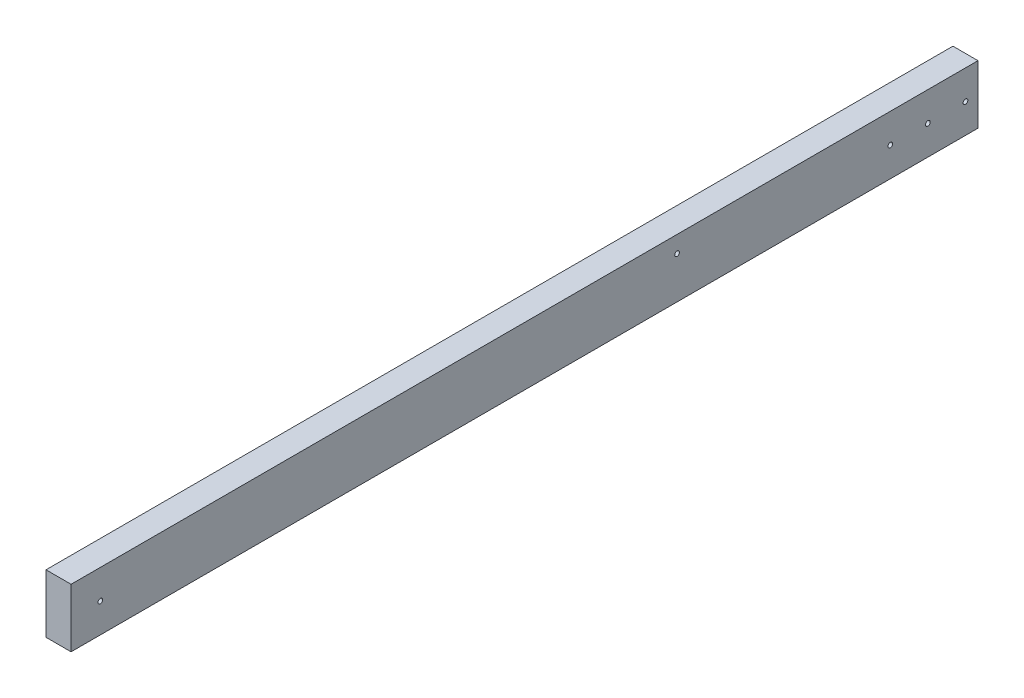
from build123d import *

# Parameters (mm, degrees)
SKETCH1_W                       = 38.1
SKETCH1_H                       = 88.9
BOSS_EXTRUDE1_DEPTH             = 1377.95
F_9_32_0_28125_DIAMETER_HOLE1_D = 7.14375


with BuildPart() as part:
    # Sketch1 → Boss-Extrude1 (new body)
    with BuildSketch(Plane.XY):
        Rectangle(SKETCH1_W, SKETCH1_H)
    extrude(amount=BOSS_EXTRUDE1_DEPTH)

    # 9_32 _0.28125_ Diameter Hole1 (through all)
    with Locations(Plane(origin=(19.05, 0, 0), x_dir=(0, 0, -1), z_dir=(1, 0, 0))):
        with Locations((-19.05, 0), (-76.2, 0), (-133.35, 0), (-1333.5, 0), (-457.2, 19.05)):
            Hole(F_9_32_0_28125_DIAMETER_HOLE1_D / 2)


solid = part.part
